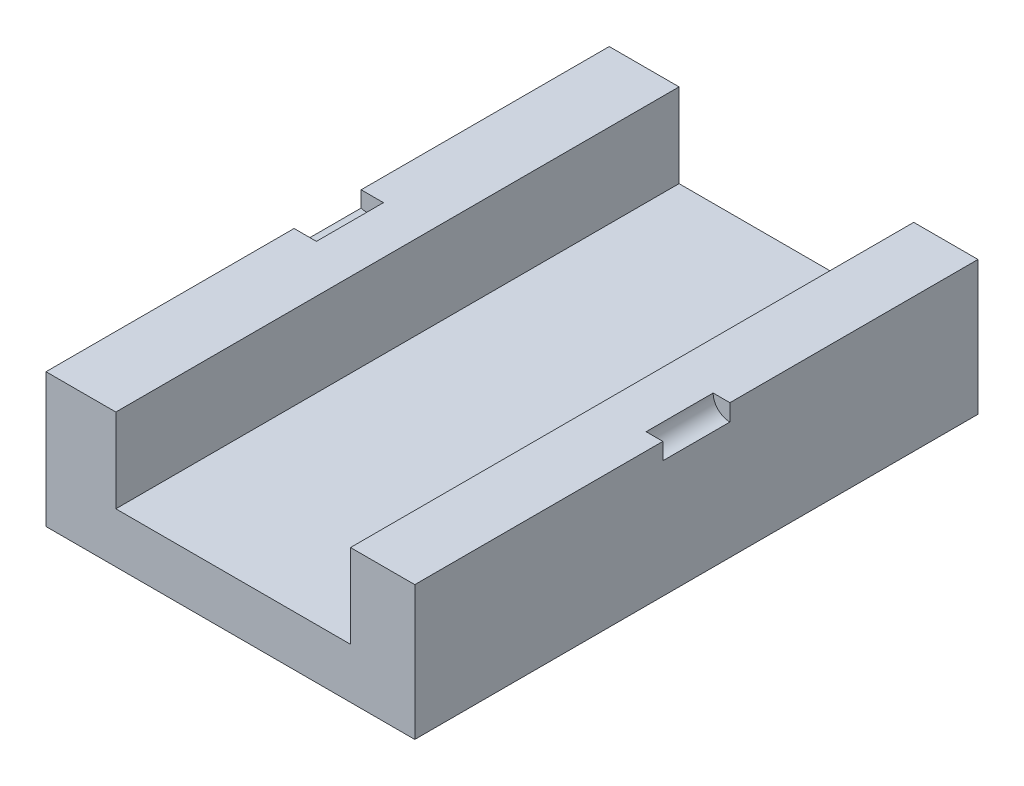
ISO-10303-21;
HEADER;
FILE_DESCRIPTION(('STEP AP214'),'2;1');
FILE_NAME('part.step','',(''),(''),'','','');
FILE_SCHEMA(('AUTOMOTIVE_DESIGN { 1 0 10303 214 1 1 1 1 }'));
ENDSEC;
DATA;
#1=APPLICATION_CONTEXT('core data for automotive mechanical design processes');
#2=APPLICATION_PROTOCOL_DEFINITION('international standard','automotive_design',2000,#1);
#3=PRODUCT_CONTEXT('',#1,'mechanical');
#4=PRODUCT('Part','Part','',(#3));
#5=PRODUCT_RELATED_PRODUCT_CATEGORY('part','',(#4));
#6=PRODUCT_DEFINITION_FORMATION('','',#4);
#7=PRODUCT_DEFINITION_CONTEXT('part definition',#1,'design');
#8=PRODUCT_DEFINITION('design','',#6,#7);
#9=PRODUCT_DEFINITION_SHAPE('','',#8);
#10=(LENGTH_UNIT() NAMED_UNIT(*) SI_UNIT(.MILLI.,.METRE.));
#11=(NAMED_UNIT(*) PLANE_ANGLE_UNIT() SI_UNIT($,.RADIAN.));
#12=(NAMED_UNIT(*) SI_UNIT($,.STERADIAN.) SOLID_ANGLE_UNIT());
#13=UNCERTAINTY_MEASURE_WITH_UNIT(LENGTH_MEASURE(1.E-05),#10,'distance_accuracy_value','');
#14=(GEOMETRIC_REPRESENTATION_CONTEXT(3) GLOBAL_UNCERTAINTY_ASSIGNED_CONTEXT((#13)) GLOBAL_UNIT_ASSIGNED_CONTEXT((#10,
#11,#12)) REPRESENTATION_CONTEXT('',''));
#15=CARTESIAN_POINT('',(0.,0.,0.));
#16=DIRECTION('',(0.,0.,1.));
#17=DIRECTION('',(1.,0.,0.));
#18=AXIS2_PLACEMENT_3D('',#15,#16,#17);
#19=CARTESIAN_POINT('',(-69.0311418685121,19.7404844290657,84.));
#20=DIRECTION('',(0.,-1.,0.));
#21=DIRECTION('',(0.,0.,-1.));
#22=AXIS2_PLACEMENT_3D('',#19,#20,#21);
#23=PLANE('',#22);
#24=DIRECTION('',(0.,0.,-1.));
#25=VECTOR('',#24,1.);
#26=CARTESIAN_POINT('',(-69.0311418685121,19.7404844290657,84.));
#27=LINE('',#26,#25);
#28=CARTESIAN_POINT('',(-69.0311418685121,19.7404844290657,-9.99999999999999));
#29=VERTEX_POINT('',#28);
#30=CARTESIAN_POINT('',(-69.0311418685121,19.7404844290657,-84.));
#31=VERTEX_POINT('',#30);
#32=EDGE_CURVE('E148',#29,#31,#27,.T.);
#33=ORIENTED_EDGE('',*,*,#32,.F.);
#34=DIRECTION('',(1.,0.,0.));
#35=VECTOR('',#34,1.);
#36=CARTESIAN_POINT('',(-69.0311418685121,19.7404844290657,-9.99999999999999));
#37=LINE('',#36,#35);
#38=CARTESIAN_POINT('',(-62.3702422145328,19.7404844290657,-10.));
#39=VERTEX_POINT('',#38);
#40=EDGE_CURVE('E143',#29,#39,#37,.T.);
#41=ORIENTED_EDGE('',*,*,#40,.T.);
#42=DIRECTION('',(0.,0.,1.));
#43=VECTOR('',#42,1.);
#44=CARTESIAN_POINT('',(-62.3702422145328,19.7404844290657,18.3384484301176));
#45=LINE('',#44,#43);
#46=CARTESIAN_POINT('',(-62.3702422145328,19.7404844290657,10.));
#47=VERTEX_POINT('',#46);
#48=EDGE_CURVE('E132',#39,#47,#45,.T.);
#49=ORIENTED_EDGE('',*,*,#48,.T.);
#50=DIRECTION('',(-1.,0.,0.));
#51=VECTOR('',#50,1.);
#52=CARTESIAN_POINT('',(-69.0311418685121,19.7404844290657,10.));
#53=LINE('',#52,#51);
#54=CARTESIAN_POINT('',(-69.0311418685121,19.7404844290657,10.));
#55=VERTEX_POINT('',#54);
#56=EDGE_CURVE('E139',#47,#55,#53,.T.);
#57=ORIENTED_EDGE('',*,*,#56,.T.);
#58=CARTESIAN_POINT('',(-69.0311418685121,19.7404844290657,84.));
#59=VERTEX_POINT('',#58);
#60=EDGE_CURVE('E221',#59,#55,#27,.T.);
#61=ORIENTED_EDGE('',*,*,#60,.F.);
#62=DIRECTION('',(-1.,0.,0.));
#63=VECTOR('',#62,1.);
#64=CARTESIAN_POINT('',(-69.0311418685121,19.7404844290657,84.));
#65=LINE('',#64,#63);
#66=CARTESIAN_POINT('',(-48.2006920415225,19.7404844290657,84.));
#67=VERTEX_POINT('',#66);
#68=EDGE_CURVE('E166',#67,#59,#65,.T.);
#69=ORIENTED_EDGE('',*,*,#68,.F.);
#70=DIRECTION('',(0.,0.,-1.));
#71=VECTOR('',#70,1.);
#72=CARTESIAN_POINT('',(-48.2006920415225,19.7404844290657,84.));
#73=LINE('',#72,#71);
#74=CARTESIAN_POINT('',(-48.2006920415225,19.7404844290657,-84.));
#75=VERTEX_POINT('',#74);
#76=EDGE_CURVE('E184',#67,#75,#73,.T.);
#77=ORIENTED_EDGE('',*,*,#76,.T.);
#78=DIRECTION('',(-1.,0.,0.));
#79=VECTOR('',#78,1.);
#80=CARTESIAN_POINT('',(-69.0311418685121,19.7404844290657,-84.));
#81=LINE('',#80,#79);
#82=EDGE_CURVE('E165',#75,#31,#81,.T.);
#83=ORIENTED_EDGE('',*,*,#82,.T.);
#84=EDGE_LOOP('',(#33,#41,#49,#57,#61,#69,#77,#83));
#85=FACE_BOUND('',#84,.T.);
#86=ADVANCED_FACE('F33',(#85),#23,.F.);
#87=CARTESIAN_POINT('',(-69.0311418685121,-20.2595155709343,84.));
#88=DIRECTION('',(1.,0.,0.));
#89=DIRECTION('',(0.,0.,-1.));
#90=AXIS2_PLACEMENT_3D('',#87,#88,#89);
#91=PLANE('',#90);
#92=DIRECTION('',(0.,0.,1.));
#93=VECTOR('',#92,1.);
#94=CARTESIAN_POINT('',(-69.0311418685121,15.0244042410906,18.3384484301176));
#95=LINE('',#94,#93);
#96=CARTESIAN_POINT('',(-69.0311418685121,15.0244042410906,10.));
#97=VERTEX_POINT('',#96);
#98=CARTESIAN_POINT('',(-69.0311418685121,15.0244042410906,-9.99999999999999));
#99=VERTEX_POINT('',#98);
#100=EDGE_CURVE('E233',#97,#99,#95,.F.);
#101=ORIENTED_EDGE('',*,*,#100,.T.);
#102=DIRECTION('',(0.,1.,0.));
#103=VECTOR('',#102,1.);
#104=CARTESIAN_POINT('',(-69.0311418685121,-20.2595155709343,-9.99999999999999));
#105=LINE('',#104,#103);
#106=EDGE_CURVE('E11',#99,#29,#105,.T.);
#107=ORIENTED_EDGE('',*,*,#106,.T.);
#108=ORIENTED_EDGE('',*,*,#32,.T.);
#109=DIRECTION('',(0.,-1.,0.));
#110=VECTOR('',#109,1.);
#111=CARTESIAN_POINT('',(-69.0311418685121,-20.2595155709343,-84.));
#112=LINE('',#111,#110);
#113=CARTESIAN_POINT('',(-69.0311418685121,-20.2595155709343,-84.));
#114=VERTEX_POINT('',#113);
#115=EDGE_CURVE('E186',#31,#114,#112,.T.);
#116=ORIENTED_EDGE('',*,*,#115,.T.);
#117=DIRECTION('',(0.,0.,-1.));
#118=VECTOR('',#117,1.);
#119=CARTESIAN_POINT('',(-69.0311418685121,-20.2595155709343,84.));
#120=LINE('',#119,#118);
#121=CARTESIAN_POINT('',(-69.0311418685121,-20.2595155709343,84.));
#122=VERTEX_POINT('',#121);
#123=EDGE_CURVE('E218',#122,#114,#120,.T.);
#124=ORIENTED_EDGE('',*,*,#123,.F.);
#125=DIRECTION('',(0.,-1.,0.));
#126=VECTOR('',#125,1.);
#127=CARTESIAN_POINT('',(-69.0311418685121,-20.2595155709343,84.));
#128=LINE('',#127,#126);
#129=EDGE_CURVE('E169',#59,#122,#128,.T.);
#130=ORIENTED_EDGE('',*,*,#129,.F.);
#131=ORIENTED_EDGE('',*,*,#60,.T.);
#132=DIRECTION('',(0.,-1.,0.));
#133=VECTOR('',#132,1.);
#134=CARTESIAN_POINT('',(-69.0311418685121,-20.2595155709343,10.));
#135=LINE('',#134,#133);
#136=EDGE_CURVE('E40',#55,#97,#135,.T.);
#137=ORIENTED_EDGE('',*,*,#136,.T.);
#138=EDGE_LOOP('',(#101,#107,#108,#116,#124,#130,#131,#137));
#139=FACE_BOUND('',#138,.T.);
#140=ADVANCED_FACE('F236',(#139),#91,.F.);
#141=CARTESIAN_POINT('',(40.9688581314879,-20.2595155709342,84.));
#142=DIRECTION('',(0.,1.,0.));
#143=DIRECTION('',(-1.,0.,0.));
#144=AXIS2_PLACEMENT_3D('',#141,#142,#143);
#145=PLANE('',#144);
#146=DIRECTION('',(1.,0.,0.));
#147=VECTOR('',#146,1.);
#148=CARTESIAN_POINT('',(40.9688581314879,-20.2595155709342,-84.));
#149=LINE('',#148,#147);
#150=CARTESIAN_POINT('',(40.9688581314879,-20.2595155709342,-84.));
#151=VERTEX_POINT('',#150);
#152=EDGE_CURVE('E188',#114,#151,#149,.T.);
#153=ORIENTED_EDGE('',*,*,#152,.T.);
#154=DIRECTION('',(0.,0.,-1.));
#155=VECTOR('',#154,1.);
#156=CARTESIAN_POINT('',(40.9688581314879,-20.2595155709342,84.));
#157=LINE('',#156,#155);
#158=CARTESIAN_POINT('',(40.9688581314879,-20.2595155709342,84.));
#159=VERTEX_POINT('',#158);
#160=EDGE_CURVE('E215',#159,#151,#157,.T.);
#161=ORIENTED_EDGE('',*,*,#160,.F.);
#162=DIRECTION('',(1.,0.,0.));
#163=VECTOR('',#162,1.);
#164=CARTESIAN_POINT('',(40.9688581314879,-20.2595155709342,84.));
#165=LINE('',#164,#163);
#166=EDGE_CURVE('E172',#122,#159,#165,.T.);
#167=ORIENTED_EDGE('',*,*,#166,.F.);
#168=ORIENTED_EDGE('',*,*,#123,.T.);
#169=EDGE_LOOP('',(#153,#161,#167,#168));
#170=FACE_BOUND('',#169,.T.);
#171=ADVANCED_FACE('F261',(#170),#145,.F.);
#172=CARTESIAN_POINT('',(40.9688581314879,19.7404844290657,84.));
#173=DIRECTION('',(-1.,0.,0.));
#174=DIRECTION('',(0.,0.,1.));
#175=AXIS2_PLACEMENT_3D('',#172,#173,#174);
#176=PLANE('',#175);
#177=DIRECTION('',(0.,0.,-1.));
#178=VECTOR('',#177,1.);
#179=CARTESIAN_POINT('',(40.9688581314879,19.7404844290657,84.));
#180=LINE('',#179,#178);
#181=CARTESIAN_POINT('',(40.9688581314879,19.7404844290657,-9.99999999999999));
#182=VERTEX_POINT('',#181);
#183=CARTESIAN_POINT('',(40.9688581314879,19.7404844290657,-84.));
#184=VERTEX_POINT('',#183);
#185=EDGE_CURVE('E211',#182,#184,#180,.T.);
#186=ORIENTED_EDGE('',*,*,#185,.F.);
#187=DIRECTION('',(0.,-1.,0.));
#188=VECTOR('',#187,1.);
#189=CARTESIAN_POINT('',(40.9688581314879,19.7404844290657,-9.99999999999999));
#190=LINE('',#189,#188);
#191=CARTESIAN_POINT('',(40.9688581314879,14.7404844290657,-10.));
#192=VERTEX_POINT('',#191);
#193=EDGE_CURVE('E162',#182,#192,#190,.T.);
#194=ORIENTED_EDGE('',*,*,#193,.T.);
#195=DIRECTION('',(0.,0.,1.));
#196=VECTOR('',#195,1.);
#197=CARTESIAN_POINT('',(40.9688581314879,14.7404844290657,18.3384484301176));
#198=LINE('',#197,#196);
#199=CARTESIAN_POINT('',(40.9688581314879,14.7404844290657,10.));
#200=VERTEX_POINT('',#199);
#201=EDGE_CURVE('E156',#192,#200,#198,.T.);
#202=ORIENTED_EDGE('',*,*,#201,.T.);
#203=DIRECTION('',(0.,1.,0.));
#204=VECTOR('',#203,1.);
#205=CARTESIAN_POINT('',(40.9688581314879,19.7404844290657,10.));
#206=LINE('',#205,#204);
#207=CARTESIAN_POINT('',(40.9688581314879,19.7404844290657,10.));
#208=VERTEX_POINT('',#207);
#209=EDGE_CURVE('E159',#200,#208,#206,.T.);
#210=ORIENTED_EDGE('',*,*,#209,.T.);
#211=CARTESIAN_POINT('',(40.9688581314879,19.7404844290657,84.));
#212=VERTEX_POINT('',#211);
#213=EDGE_CURVE('E212',#212,#208,#180,.T.);
#214=ORIENTED_EDGE('',*,*,#213,.F.);
#215=DIRECTION('',(0.,1.,0.));
#216=VECTOR('',#215,1.);
#217=CARTESIAN_POINT('',(40.9688581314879,19.7404844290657,84.));
#218=LINE('',#217,#216);
#219=EDGE_CURVE('E174',#159,#212,#218,.T.);
#220=ORIENTED_EDGE('',*,*,#219,.F.);
#221=ORIENTED_EDGE('',*,*,#160,.T.);
#222=DIRECTION('',(0.,1.,0.));
#223=VECTOR('',#222,1.);
#224=CARTESIAN_POINT('',(40.9688581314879,19.7404844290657,-84.));
#225=LINE('',#224,#223);
#226=EDGE_CURVE('E190',#151,#184,#225,.T.);
#227=ORIENTED_EDGE('',*,*,#226,.T.);
#228=EDGE_LOOP('',(#186,#194,#202,#210,#214,#220,#221,#227));
#229=FACE_BOUND('',#228,.T.);
#230=ADVANCED_FACE('F269',(#229),#176,.F.);
#231=CARTESIAN_POINT('',(21.7993079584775,19.7404844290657,84.));
#232=DIRECTION('',(0.,-1.,0.));
#233=DIRECTION('',(0.,0.,-1.));
#234=AXIS2_PLACEMENT_3D('',#231,#232,#233);
#235=PLANE('',#234);
#236=DIRECTION('',(0.,0.,1.));
#237=VECTOR('',#236,1.);
#238=CARTESIAN_POINT('',(35.9688581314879,19.7404844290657,18.3384484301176));
#239=LINE('',#238,#237);
#240=CARTESIAN_POINT('',(35.9688581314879,19.7404844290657,10.));
#241=VERTEX_POINT('',#240);
#242=CARTESIAN_POINT('',(35.9688581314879,19.7404844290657,-9.99999999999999));
#243=VERTEX_POINT('',#242);
#244=EDGE_CURVE('E224',#241,#243,#239,.F.);
#245=ORIENTED_EDGE('',*,*,#244,.T.);
#246=DIRECTION('',(1.,0.,0.));
#247=VECTOR('',#246,1.);
#248=CARTESIAN_POINT('',(21.7993079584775,19.7404844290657,-9.99999999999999));
#249=LINE('',#248,#247);
#250=EDGE_CURVE('E230',#243,#182,#249,.T.);
#251=ORIENTED_EDGE('',*,*,#250,.T.);
#252=ORIENTED_EDGE('',*,*,#185,.T.);
#253=DIRECTION('',(-1.,0.,0.));
#254=VECTOR('',#253,1.);
#255=CARTESIAN_POINT('',(21.7993079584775,19.7404844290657,-84.));
#256=LINE('',#255,#254);
#257=CARTESIAN_POINT('',(21.7993079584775,19.7404844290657,-84.));
#258=VERTEX_POINT('',#257);
#259=EDGE_CURVE('E193',#184,#258,#256,.T.);
#260=ORIENTED_EDGE('',*,*,#259,.T.);
#261=DIRECTION('',(0.,0.,-1.));
#262=VECTOR('',#261,1.);
#263=CARTESIAN_POINT('',(21.7993079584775,19.7404844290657,84.));
#264=LINE('',#263,#262);
#265=CARTESIAN_POINT('',(21.7993079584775,19.7404844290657,84.));
#266=VERTEX_POINT('',#265);
#267=EDGE_CURVE('E208',#266,#258,#264,.T.);
#268=ORIENTED_EDGE('',*,*,#267,.F.);
#269=DIRECTION('',(-1.,0.,0.));
#270=VECTOR('',#269,1.);
#271=CARTESIAN_POINT('',(21.7993079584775,19.7404844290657,84.));
#272=LINE('',#271,#270);
#273=EDGE_CURVE('E176',#212,#266,#272,.T.);
#274=ORIENTED_EDGE('',*,*,#273,.F.);
#275=ORIENTED_EDGE('',*,*,#213,.T.);
#276=DIRECTION('',(-1.,0.,0.));
#277=VECTOR('',#276,1.);
#278=CARTESIAN_POINT('',(21.7993079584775,19.7404844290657,10.));
#279=LINE('',#278,#277);
#280=EDGE_CURVE('E227',#208,#241,#279,.T.);
#281=ORIENTED_EDGE('',*,*,#280,.T.);
#282=EDGE_LOOP('',(#245,#251,#252,#260,#268,#274,#275,#281));
#283=FACE_BOUND('',#282,.T.);
#284=ADVANCED_FACE('F271',(#283),#235,.F.);
#285=CARTESIAN_POINT('',(21.7993079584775,-5.25951557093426,84.));
#286=DIRECTION('',(1.,0.,0.));
#287=DIRECTION('',(0.,0.,-1.));
#288=AXIS2_PLACEMENT_3D('',#285,#286,#287);
#289=PLANE('',#288);
#290=DIRECTION('',(0.,-1.,0.));
#291=VECTOR('',#290,1.);
#292=CARTESIAN_POINT('',(21.7993079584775,-5.25951557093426,-84.));
#293=LINE('',#292,#291);
#294=CARTESIAN_POINT('',(21.7993079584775,-5.25951557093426,-84.));
#295=VERTEX_POINT('',#294);
#296=EDGE_CURVE('E195',#258,#295,#293,.T.);
#297=ORIENTED_EDGE('',*,*,#296,.T.);
#298=DIRECTION('',(0.,0.,-1.));
#299=VECTOR('',#298,1.);
#300=CARTESIAN_POINT('',(21.7993079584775,-5.25951557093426,84.));
#301=LINE('',#300,#299);
#302=CARTESIAN_POINT('',(21.7993079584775,-5.25951557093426,84.));
#303=VERTEX_POINT('',#302);
#304=EDGE_CURVE('E205',#303,#295,#301,.T.);
#305=ORIENTED_EDGE('',*,*,#304,.F.);
#306=DIRECTION('',(0.,-1.,0.));
#307=VECTOR('',#306,1.);
#308=CARTESIAN_POINT('',(21.7993079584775,-5.25951557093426,84.));
#309=LINE('',#308,#307);
#310=EDGE_CURVE('E178',#266,#303,#309,.T.);
#311=ORIENTED_EDGE('',*,*,#310,.F.);
#312=ORIENTED_EDGE('',*,*,#267,.T.);
#313=EDGE_LOOP('',(#297,#305,#311,#312));
#314=FACE_BOUND('',#313,.T.);
#315=ADVANCED_FACE('F276',(#314),#289,.F.);
#316=CARTESIAN_POINT('',(-48.2006920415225,-5.25951557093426,84.));
#317=DIRECTION('',(0.,-1.,0.));
#318=DIRECTION('',(0.,0.,-1.));
#319=AXIS2_PLACEMENT_3D('',#316,#317,#318);
#320=PLANE('',#319);
#321=DIRECTION('',(-1.,0.,0.));
#322=VECTOR('',#321,1.);
#323=CARTESIAN_POINT('',(-48.2006920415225,-5.25951557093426,-84.));
#324=LINE('',#323,#322);
#325=CARTESIAN_POINT('',(-48.2006920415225,-5.25951557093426,-84.));
#326=VERTEX_POINT('',#325);
#327=EDGE_CURVE('E197',#295,#326,#324,.T.);
#328=ORIENTED_EDGE('',*,*,#327,.T.);
#329=DIRECTION('',(0.,0.,-1.));
#330=VECTOR('',#329,1.);
#331=CARTESIAN_POINT('',(-48.2006920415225,-5.25951557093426,84.));
#332=LINE('',#331,#330);
#333=CARTESIAN_POINT('',(-48.2006920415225,-5.25951557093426,84.));
#334=VERTEX_POINT('',#333);
#335=EDGE_CURVE('E202',#334,#326,#332,.T.);
#336=ORIENTED_EDGE('',*,*,#335,.F.);
#337=DIRECTION('',(-1.,0.,0.));
#338=VECTOR('',#337,1.);
#339=CARTESIAN_POINT('',(-48.2006920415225,-5.25951557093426,84.));
#340=LINE('',#339,#338);
#341=EDGE_CURVE('E180',#303,#334,#340,.T.);
#342=ORIENTED_EDGE('',*,*,#341,.F.);
#343=ORIENTED_EDGE('',*,*,#304,.T.);
#344=EDGE_LOOP('',(#328,#336,#342,#343));
#345=FACE_BOUND('',#344,.T.);
#346=ADVANCED_FACE('F278',(#345),#320,.F.);
#347=CARTESIAN_POINT('',(-48.2006920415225,19.7404844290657,84.));
#348=DIRECTION('',(-1.,0.,0.));
#349=DIRECTION('',(0.,0.,1.));
#350=AXIS2_PLACEMENT_3D('',#347,#348,#349);
#351=PLANE('',#350);
#352=DIRECTION('',(0.,1.,0.));
#353=VECTOR('',#352,1.);
#354=CARTESIAN_POINT('',(-48.2006920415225,19.7404844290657,-84.));
#355=LINE('',#354,#353);
#356=EDGE_CURVE('E170',#326,#75,#355,.T.);
#357=ORIENTED_EDGE('',*,*,#356,.T.);
#358=ORIENTED_EDGE('',*,*,#76,.F.);
#359=DIRECTION('',(0.,1.,0.));
#360=VECTOR('',#359,1.);
#361=CARTESIAN_POINT('',(-48.2006920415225,19.7404844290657,84.));
#362=LINE('',#361,#360);
#363=EDGE_CURVE('E182',#334,#67,#362,.T.);
#364=ORIENTED_EDGE('',*,*,#363,.F.);
#365=ORIENTED_EDGE('',*,*,#335,.T.);
#366=EDGE_LOOP('',(#357,#358,#364,#365));
#367=FACE_BOUND('',#366,.T.);
#368=ADVANCED_FACE('F250',(#367),#351,.F.);
#369=CARTESIAN_POINT('',(0.,0.,84.));
#370=DIRECTION('',(0.,0.,-1.));
#371=DIRECTION('',(-1.,0.,0.));
#372=AXIS2_PLACEMENT_3D('',#369,#370,#371);
#373=PLANE('',#372);
#374=ORIENTED_EDGE('',*,*,#68,.T.);
#375=ORIENTED_EDGE('',*,*,#129,.T.);
#376=ORIENTED_EDGE('',*,*,#166,.T.);
#377=ORIENTED_EDGE('',*,*,#219,.T.);
#378=ORIENTED_EDGE('',*,*,#273,.T.);
#379=ORIENTED_EDGE('',*,*,#310,.T.);
#380=ORIENTED_EDGE('',*,*,#341,.T.);
#381=ORIENTED_EDGE('',*,*,#363,.T.);
#382=EDGE_LOOP('',(#374,#375,#376,#377,#378,#379,#380,#381));
#383=FACE_BOUND('',#382,.T.);
#384=ADVANCED_FACE('F244',(#383),#373,.F.);
#385=CARTESIAN_POINT('',(0.,0.,-84.));
#386=DIRECTION('',(0.,0.,-1.));
#387=DIRECTION('',(-1.,0.,0.));
#388=AXIS2_PLACEMENT_3D('',#385,#386,#387);
#389=PLANE('',#388);
#390=ORIENTED_EDGE('',*,*,#82,.F.);
#391=ORIENTED_EDGE('',*,*,#356,.F.);
#392=ORIENTED_EDGE('',*,*,#327,.F.);
#393=ORIENTED_EDGE('',*,*,#296,.F.);
#394=ORIENTED_EDGE('',*,*,#259,.F.);
#395=ORIENTED_EDGE('',*,*,#226,.F.);
#396=ORIENTED_EDGE('',*,*,#152,.F.);
#397=ORIENTED_EDGE('',*,*,#115,.F.);
#398=EDGE_LOOP('',(#390,#391,#392,#393,#394,#395,#396,#397));
#399=FACE_BOUND('',#398,.T.);
#400=ADVANCED_FACE('F254',(#399),#389,.T.);
#401=CARTESIAN_POINT('',(40.9688581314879,19.7404844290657,-10.));
#402=DIRECTION('',(0.,0.,-1.));
#403=DIRECTION('',(-1.,0.,0.));
#404=AXIS2_PLACEMENT_3D('',#401,#402,#403);
#405=PLANE('',#404);
#406=ORIENTED_EDGE('',*,*,#250,.F.);
#407=CARTESIAN_POINT('',(40.9688581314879,19.7404844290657,-10.));
#408=DIRECTION('',(0.,0.,1.));
#409=DIRECTION('',(1.,0.,0.));
#410=AXIS2_PLACEMENT_3D('',#407,#408,#409);
#411=CIRCLE('',#410,5.);
#412=EDGE_CURVE('E55',#243,#192,#411,.T.);
#413=ORIENTED_EDGE('',*,*,#412,.T.);
#414=ORIENTED_EDGE('',*,*,#193,.F.);
#415=EDGE_LOOP('',(#406,#413,#414));
#416=FACE_BOUND('',#415,.T.);
#417=ADVANCED_FACE('F337',(#416),#405,.F.);
#418=CARTESIAN_POINT('',(40.9688581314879,19.7404844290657,10.));
#419=DIRECTION('',(0.,0.,1.));
#420=DIRECTION('',(1.,0.,0.));
#421=AXIS2_PLACEMENT_3D('',#418,#419,#420);
#422=PLANE('',#421);
#423=CARTESIAN_POINT('',(40.9688581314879,19.7404844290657,10.));
#424=DIRECTION('',(0.,0.,1.));
#425=DIRECTION('',(1.,0.,0.));
#426=AXIS2_PLACEMENT_3D('',#423,#424,#425);
#427=CIRCLE('',#426,5.);
#428=EDGE_CURVE('E150',#241,#200,#427,.T.);
#429=ORIENTED_EDGE('',*,*,#428,.F.);
#430=ORIENTED_EDGE('',*,*,#280,.F.);
#431=ORIENTED_EDGE('',*,*,#209,.F.);
#432=EDGE_LOOP('',(#429,#430,#431));
#433=FACE_BOUND('',#432,.T.);
#434=ADVANCED_FACE('F367',(#433),#422,.F.);
#435=CARTESIAN_POINT('',(40.9688581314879,19.7404844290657,18.3384484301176));
#436=DIRECTION('',(0.,0.,1.));
#437=DIRECTION('',(1.,0.,0.));
#438=AXIS2_PLACEMENT_3D('',#435,#436,#437);
#439=CYLINDRICAL_SURFACE('',#438,5.);
#440=ORIENTED_EDGE('',*,*,#412,.F.);
#441=ORIENTED_EDGE('',*,*,#244,.F.);
#442=ORIENTED_EDGE('',*,*,#428,.T.);
#443=ORIENTED_EDGE('',*,*,#201,.F.);
#444=EDGE_LOOP('',(#440,#441,#442,#443));
#445=FACE_BOUND('',#444,.T.);
#446=ADVANCED_FACE('F362',(#445),#439,.F.);
#447=CARTESIAN_POINT('',(-67.3702422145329,19.7404844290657,-10.));
#448=DIRECTION('',(0.,0.,-1.));
#449=DIRECTION('',(1.,0.,0.));
#450=AXIS2_PLACEMENT_3D('',#447,#448,#449);
#451=PLANE('',#450);
#452=ORIENTED_EDGE('',*,*,#106,.F.);
#453=CARTESIAN_POINT('',(-67.3702422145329,19.7404844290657,-10.));
#454=DIRECTION('',(0.,0.,-1.));
#455=DIRECTION('',(-1.,0.,0.));
#456=AXIS2_PLACEMENT_3D('',#453,#454,#455);
#457=CIRCLE('',#456,5.);
#458=EDGE_CURVE('E47',#39,#99,#457,.T.);
#459=ORIENTED_EDGE('',*,*,#458,.F.);
#460=ORIENTED_EDGE('',*,*,#40,.F.);
#461=EDGE_LOOP('',(#452,#459,#460));
#462=FACE_BOUND('',#461,.T.);
#463=ADVANCED_FACE('F142',(#462),#451,.F.);
#464=CARTESIAN_POINT('',(-67.3702422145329,19.7404844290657,10.));
#465=DIRECTION('',(0.,0.,1.));
#466=DIRECTION('',(-1.,0.,0.));
#467=AXIS2_PLACEMENT_3D('',#464,#465,#466);
#468=PLANE('',#467);
#469=CARTESIAN_POINT('',(-67.3702422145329,19.7404844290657,10.));
#470=DIRECTION('',(0.,0.,-1.));
#471=DIRECTION('',(-1.,0.,0.));
#472=AXIS2_PLACEMENT_3D('',#469,#470,#471);
#473=CIRCLE('',#472,5.);
#474=EDGE_CURVE('E135',#47,#97,#473,.T.);
#475=ORIENTED_EDGE('',*,*,#474,.T.);
#476=ORIENTED_EDGE('',*,*,#136,.F.);
#477=ORIENTED_EDGE('',*,*,#56,.F.);
#478=EDGE_LOOP('',(#475,#476,#477));
#479=FACE_BOUND('',#478,.T.);
#480=ADVANCED_FACE('F239',(#479),#468,.F.);
#481=CARTESIAN_POINT('',(-67.3702422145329,19.7404844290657,18.3384484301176));
#482=DIRECTION('',(0.,0.,1.));
#483=DIRECTION('',(-1.,0.,0.));
#484=AXIS2_PLACEMENT_3D('',#481,#482,#483);
#485=CYLINDRICAL_SURFACE('',#484,5.);
#486=ORIENTED_EDGE('',*,*,#458,.T.);
#487=ORIENTED_EDGE('',*,*,#100,.F.);
#488=ORIENTED_EDGE('',*,*,#474,.F.);
#489=ORIENTED_EDGE('',*,*,#48,.F.);
#490=EDGE_LOOP('',(#486,#487,#488,#489));
#491=FACE_BOUND('',#490,.T.);
#492=ADVANCED_FACE('F133',(#491),#485,.F.);
#493=CLOSED_SHELL('',(#86,#140,#171,#230,#284,#315,#346,#368,#384,#400,#417,#434,#446,#463,#480,#492));
#494=MANIFOLD_SOLID_BREP('B2',#493);
#495=ADVANCED_BREP_SHAPE_REPRESENTATION('',(#18,#494),#14);
#496=SHAPE_DEFINITION_REPRESENTATION(#9,#495);
ENDSEC;
END-ISO-10303-21;
